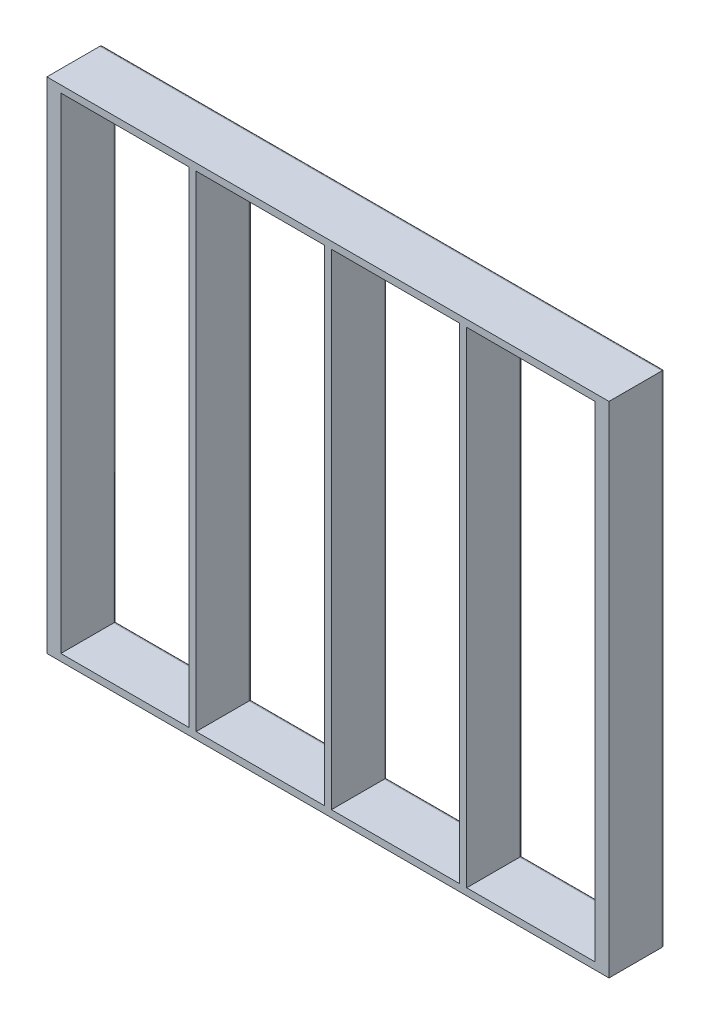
ISO-10303-21;
HEADER;
FILE_DESCRIPTION(('STEP AP214'),'2;1');
FILE_NAME('part.step','',(''),(''),'','','');
FILE_SCHEMA(('AUTOMOTIVE_DESIGN { 1 0 10303 214 1 1 1 1 }'));
ENDSEC;
DATA;
#1=APPLICATION_CONTEXT('core data for automotive mechanical design processes');
#2=APPLICATION_PROTOCOL_DEFINITION('international standard','automotive_design',2000,#1);
#3=PRODUCT_CONTEXT('',#1,'mechanical');
#4=PRODUCT('Part','Part','',(#3));
#5=PRODUCT_RELATED_PRODUCT_CATEGORY('part','',(#4));
#6=PRODUCT_DEFINITION_FORMATION('','',#4);
#7=PRODUCT_DEFINITION_CONTEXT('part definition',#1,'design');
#8=PRODUCT_DEFINITION('design','',#6,#7);
#9=PRODUCT_DEFINITION_SHAPE('','',#8);
#10=(LENGTH_UNIT() NAMED_UNIT(*) SI_UNIT(.MILLI.,.METRE.));
#11=(NAMED_UNIT(*) PLANE_ANGLE_UNIT() SI_UNIT($,.RADIAN.));
#12=(NAMED_UNIT(*) SI_UNIT($,.STERADIAN.) SOLID_ANGLE_UNIT());
#13=UNCERTAINTY_MEASURE_WITH_UNIT(LENGTH_MEASURE(1.E-05),#10,'distance_accuracy_value','');
#14=(GEOMETRIC_REPRESENTATION_CONTEXT(3) GLOBAL_UNCERTAINTY_ASSIGNED_CONTEXT((#13)) GLOBAL_UNIT_ASSIGNED_CONTEXT((#10,
#11,#12)) REPRESENTATION_CONTEXT('',''));
#15=CARTESIAN_POINT('',(0.,0.,0.));
#16=DIRECTION('',(0.,0.,1.));
#17=DIRECTION('',(1.,0.,0.));
#18=AXIS2_PLACEMENT_3D('',#15,#16,#17);
#19=CARTESIAN_POINT('',(168.5,0.,20.));
#20=DIRECTION('',(-1.,0.,0.));
#21=DIRECTION('',(0.,0.,1.));
#22=AXIS2_PLACEMENT_3D('',#19,#20,#21);
#23=PLANE('',#22);
#24=DIRECTION('',(0.,0.,-1.));
#25=VECTOR('',#24,1.);
#26=CARTESIAN_POINT('',(168.5,87.,20.));
#27=LINE('',#26,#25);
#28=CARTESIAN_POINT('',(168.5,87.,20.));
#29=VERTEX_POINT('',#28);
#30=CARTESIAN_POINT('',(168.5,87.,1.));
#31=VERTEX_POINT('',#30);
#32=EDGE_CURVE('E342',#29,#31,#27,.T.);
#33=ORIENTED_EDGE('',*,*,#32,.T.);
#34=DIRECTION('',(0.,1.,0.));
#35=VECTOR('',#34,1.);
#36=CARTESIAN_POINT('',(168.5,-87.,1.));
#37=LINE('',#36,#35);
#38=CARTESIAN_POINT('',(168.5,-87.,1.));
#39=VERTEX_POINT('',#38);
#40=EDGE_CURVE('E487',#31,#39,#37,.F.);
#41=ORIENTED_EDGE('',*,*,#40,.T.);
#42=DIRECTION('',(0.,0.,-1.));
#43=VECTOR('',#42,1.);
#44=CARTESIAN_POINT('',(168.5,-87.,20.));
#45=LINE('',#44,#43);
#46=CARTESIAN_POINT('',(168.5,-87.,20.));
#47=VERTEX_POINT('',#46);
#48=EDGE_CURVE('E355',#47,#39,#45,.T.);
#49=ORIENTED_EDGE('',*,*,#48,.F.);
#50=DIRECTION('',(0.,1.,0.));
#51=VECTOR('',#50,1.);
#52=CARTESIAN_POINT('',(168.5,0.,20.));
#53=LINE('',#52,#51);
#54=EDGE_CURVE('E326',#47,#29,#53,.T.);
#55=ORIENTED_EDGE('',*,*,#54,.T.);
#56=EDGE_LOOP('',(#33,#41,#49,#55));
#57=FACE_BOUND('',#56,.T.);
#58=ADVANCED_FACE('F47',(#57),#23,.T.);
#59=CARTESIAN_POINT('',(0.,-87.,20.));
#60=DIRECTION('',(0.,-1.,0.));
#61=DIRECTION('',(0.,0.,-1.));
#62=AXIS2_PLACEMENT_3D('',#59,#60,#61);
#63=PLANE('',#62);
#64=ORIENTED_EDGE('',*,*,#48,.T.);
#65=DIRECTION('',(-1.,0.,0.));
#66=VECTOR('',#65,1.);
#67=CARTESIAN_POINT('',(0.,-87.,1.));
#68=LINE('',#67,#66);
#69=CARTESIAN_POINT('',(122.5,-87.,1.));
#70=VERTEX_POINT('',#69);
#71=EDGE_CURVE('E359',#39,#70,#68,.T.);
#72=ORIENTED_EDGE('',*,*,#71,.T.);
#73=DIRECTION('',(0.,0.,-1.));
#74=VECTOR('',#73,1.);
#75=CARTESIAN_POINT('',(122.5,-87.,20.));
#76=LINE('',#75,#74);
#77=CARTESIAN_POINT('',(122.5,-87.,20.));
#78=VERTEX_POINT('',#77);
#79=EDGE_CURVE('E351',#78,#70,#76,.T.);
#80=ORIENTED_EDGE('',*,*,#79,.F.);
#81=DIRECTION('',(-1.,0.,0.));
#82=VECTOR('',#81,1.);
#83=CARTESIAN_POINT('',(0.,-87.,20.));
#84=LINE('',#83,#82);
#85=EDGE_CURVE('E330',#47,#78,#84,.T.);
#86=ORIENTED_EDGE('',*,*,#85,.F.);
#87=EDGE_LOOP('',(#64,#72,#80,#86));
#88=FACE_BOUND('',#87,.T.);
#89=ADVANCED_FACE('F634',(#88),#63,.F.);
#90=CARTESIAN_POINT('',(122.5,0.,20.));
#91=DIRECTION('',(-1.,0.,0.));
#92=DIRECTION('',(0.,0.,1.));
#93=AXIS2_PLACEMENT_3D('',#90,#91,#92);
#94=PLANE('',#93);
#95=ORIENTED_EDGE('',*,*,#79,.T.);
#96=DIRECTION('',(0.,1.,0.));
#97=VECTOR('',#96,1.);
#98=CARTESIAN_POINT('',(122.5,0.,1.));
#99=LINE('',#98,#97);
#100=CARTESIAN_POINT('',(122.5,87.,1.));
#101=VERTEX_POINT('',#100);
#102=EDGE_CURVE('E481',#70,#101,#99,.T.);
#103=ORIENTED_EDGE('',*,*,#102,.T.);
#104=DIRECTION('',(0.,0.,-1.));
#105=VECTOR('',#104,1.);
#106=CARTESIAN_POINT('',(122.5,87.,20.));
#107=LINE('',#106,#105);
#108=CARTESIAN_POINT('',(122.5,87.,20.));
#109=VERTEX_POINT('',#108);
#110=EDGE_CURVE('E346',#109,#101,#107,.T.);
#111=ORIENTED_EDGE('',*,*,#110,.F.);
#112=DIRECTION('',(0.,1.,0.));
#113=VECTOR('',#112,1.);
#114=CARTESIAN_POINT('',(122.5,0.,20.));
#115=LINE('',#114,#113);
#116=EDGE_CURVE('E334',#78,#109,#115,.T.);
#117=ORIENTED_EDGE('',*,*,#116,.F.);
#118=EDGE_LOOP('',(#95,#103,#111,#117));
#119=FACE_BOUND('',#118,.T.);
#120=ADVANCED_FACE('F641',(#119),#94,.F.);
#121=CARTESIAN_POINT('',(120.,0.,20.));
#122=DIRECTION('',(-1.,0.,0.));
#123=DIRECTION('',(0.,-1.,0.));
#124=AXIS2_PLACEMENT_3D('',#121,#122,#123);
#125=PLANE('',#124);
#126=DIRECTION('',(0.,0.,-1.));
#127=VECTOR('',#126,1.);
#128=CARTESIAN_POINT('',(120.,87.,20.));
#129=LINE('',#128,#127);
#130=CARTESIAN_POINT('',(120.,87.,20.));
#131=VERTEX_POINT('',#130);
#132=CARTESIAN_POINT('',(120.,87.,1.));
#133=VERTEX_POINT('',#132);
#134=EDGE_CURVE('E360',#131,#133,#129,.T.);
#135=ORIENTED_EDGE('',*,*,#134,.T.);
#136=DIRECTION('',(0.,1.,0.));
#137=VECTOR('',#136,1.);
#138=CARTESIAN_POINT('',(120.,-87.,1.));
#139=LINE('',#138,#137);
#140=CARTESIAN_POINT('',(120.,-87.,1.));
#141=VERTEX_POINT('',#140);
#142=EDGE_CURVE('E500',#133,#141,#139,.F.);
#143=ORIENTED_EDGE('',*,*,#142,.T.);
#144=DIRECTION('',(0.,0.,-1.));
#145=VECTOR('',#144,1.);
#146=CARTESIAN_POINT('',(120.,-87.,20.));
#147=LINE('',#146,#145);
#148=CARTESIAN_POINT('',(120.,-87.,20.));
#149=VERTEX_POINT('',#148);
#150=EDGE_CURVE('E347',#149,#141,#147,.T.);
#151=ORIENTED_EDGE('',*,*,#150,.F.);
#152=DIRECTION('',(0.,1.,0.));
#153=VECTOR('',#152,1.);
#154=CARTESIAN_POINT('',(120.,0.,20.));
#155=LINE('',#154,#153);
#156=EDGE_CURVE('E311',#149,#131,#155,.T.);
#157=ORIENTED_EDGE('',*,*,#156,.T.);
#158=EDGE_LOOP('',(#135,#143,#151,#157));
#159=FACE_BOUND('',#158,.T.);
#160=ADVANCED_FACE('F658',(#159),#125,.T.);
#161=CARTESIAN_POINT('',(0.,-87.,20.));
#162=DIRECTION('',(0.,-1.,0.));
#163=DIRECTION('',(0.,0.,-1.));
#164=AXIS2_PLACEMENT_3D('',#161,#162,#163);
#165=PLANE('',#164);
#166=ORIENTED_EDGE('',*,*,#150,.T.);
#167=DIRECTION('',(-1.,0.,0.));
#168=VECTOR('',#167,1.);
#169=CARTESIAN_POINT('',(0.,-87.,1.));
#170=LINE('',#169,#168);
#171=CARTESIAN_POINT('',(74.,-87.,1.));
#172=VERTEX_POINT('',#171);
#173=EDGE_CURVE('E490',#141,#172,#170,.T.);
#174=ORIENTED_EDGE('',*,*,#173,.T.);
#175=DIRECTION('',(0.,0.,-1.));
#176=VECTOR('',#175,1.);
#177=CARTESIAN_POINT('',(74.,-87.,20.));
#178=LINE('',#177,#176);
#179=CARTESIAN_POINT('',(74.,-87.,20.));
#180=VERTEX_POINT('',#179);
#181=EDGE_CURVE('E369',#180,#172,#178,.T.);
#182=ORIENTED_EDGE('',*,*,#181,.F.);
#183=DIRECTION('',(-1.,0.,0.));
#184=VECTOR('',#183,1.);
#185=CARTESIAN_POINT('',(0.,-87.,20.));
#186=LINE('',#185,#184);
#187=EDGE_CURVE('E315',#149,#180,#186,.T.);
#188=ORIENTED_EDGE('',*,*,#187,.F.);
#189=EDGE_LOOP('',(#166,#174,#182,#188));
#190=FACE_BOUND('',#189,.T.);
#191=ADVANCED_FACE('F654',(#190),#165,.F.);
#192=CARTESIAN_POINT('',(74.,0.,20.));
#193=DIRECTION('',(-1.,0.,0.));
#194=DIRECTION('',(0.,-1.,0.));
#195=AXIS2_PLACEMENT_3D('',#192,#193,#194);
#196=PLANE('',#195);
#197=ORIENTED_EDGE('',*,*,#181,.T.);
#198=DIRECTION('',(0.,1.,0.));
#199=VECTOR('',#198,1.);
#200=CARTESIAN_POINT('',(74.,0.,1.));
#201=LINE('',#200,#199);
#202=CARTESIAN_POINT('',(74.,87.,1.));
#203=VERTEX_POINT('',#202);
#204=EDGE_CURVE('E494',#172,#203,#201,.T.);
#205=ORIENTED_EDGE('',*,*,#204,.T.);
#206=DIRECTION('',(0.,0.,-1.));
#207=VECTOR('',#206,1.);
#208=CARTESIAN_POINT('',(74.,87.,20.));
#209=LINE('',#208,#207);
#210=CARTESIAN_POINT('',(74.,87.,20.));
#211=VERTEX_POINT('',#210);
#212=EDGE_CURVE('E364',#211,#203,#209,.T.);
#213=ORIENTED_EDGE('',*,*,#212,.F.);
#214=DIRECTION('',(0.,1.,0.));
#215=VECTOR('',#214,1.);
#216=CARTESIAN_POINT('',(74.,0.,20.));
#217=LINE('',#216,#215);
#218=EDGE_CURVE('E319',#180,#211,#217,.T.);
#219=ORIENTED_EDGE('',*,*,#218,.F.);
#220=EDGE_LOOP('',(#197,#205,#213,#219));
#221=FACE_BOUND('',#220,.T.);
#222=ADVANCED_FACE('F650',(#221),#196,.F.);
#223=CARTESIAN_POINT('',(71.5,0.,20.));
#224=DIRECTION('',(-1.,0.,0.));
#225=DIRECTION('',(0.,-1.,0.));
#226=AXIS2_PLACEMENT_3D('',#223,#224,#225);
#227=PLANE('',#226);
#228=DIRECTION('',(0.,0.,-1.));
#229=VECTOR('',#228,1.);
#230=CARTESIAN_POINT('',(71.5,87.,20.));
#231=LINE('',#230,#229);
#232=CARTESIAN_POINT('',(71.5,87.,20.));
#233=VERTEX_POINT('',#232);
#234=CARTESIAN_POINT('',(71.5,87.,1.));
#235=VERTEX_POINT('',#234);
#236=EDGE_CURVE('E376',#233,#235,#231,.T.);
#237=ORIENTED_EDGE('',*,*,#236,.T.);
#238=DIRECTION('',(0.,1.,0.));
#239=VECTOR('',#238,1.);
#240=CARTESIAN_POINT('',(71.5,-87.,1.));
#241=LINE('',#240,#239);
#242=CARTESIAN_POINT('',(71.5,-87.,1.));
#243=VERTEX_POINT('',#242);
#244=EDGE_CURVE('E513',#235,#243,#241,.F.);
#245=ORIENTED_EDGE('',*,*,#244,.T.);
#246=DIRECTION('',(0.,0.,-1.));
#247=VECTOR('',#246,1.);
#248=CARTESIAN_POINT('',(71.5,-87.,20.));
#249=LINE('',#248,#247);
#250=CARTESIAN_POINT('',(71.5,-87.,20.));
#251=VERTEX_POINT('',#250);
#252=EDGE_CURVE('E365',#251,#243,#249,.T.);
#253=ORIENTED_EDGE('',*,*,#252,.F.);
#254=DIRECTION('',(0.,1.,0.));
#255=VECTOR('',#254,1.);
#256=CARTESIAN_POINT('',(71.5,0.,20.));
#257=LINE('',#256,#255);
#258=EDGE_CURVE('E296',#251,#233,#257,.T.);
#259=ORIENTED_EDGE('',*,*,#258,.T.);
#260=EDGE_LOOP('',(#237,#245,#253,#259));
#261=FACE_BOUND('',#260,.T.);
#262=ADVANCED_FACE('F653',(#261),#227,.T.);
#263=CARTESIAN_POINT('',(0.,-87.,20.));
#264=DIRECTION('',(0.,1.,0.));
#265=DIRECTION('',(-1.,0.,0.));
#266=AXIS2_PLACEMENT_3D('',#263,#264,#265);
#267=PLANE('',#266);
#268=ORIENTED_EDGE('',*,*,#252,.T.);
#269=DIRECTION('',(1.,0.,0.));
#270=VECTOR('',#269,1.);
#271=CARTESIAN_POINT('',(25.5,-87.,1.));
#272=LINE('',#271,#270);
#273=CARTESIAN_POINT('',(25.5,-87.,1.));
#274=VERTEX_POINT('',#273);
#275=EDGE_CURVE('E503',#243,#274,#272,.F.);
#276=ORIENTED_EDGE('',*,*,#275,.T.);
#277=DIRECTION('',(0.,0.,-1.));
#278=VECTOR('',#277,1.);
#279=CARTESIAN_POINT('',(25.5,-87.,20.));
#280=LINE('',#279,#278);
#281=CARTESIAN_POINT('',(25.5,-87.,20.));
#282=VERTEX_POINT('',#281);
#283=EDGE_CURVE('E385',#282,#274,#280,.T.);
#284=ORIENTED_EDGE('',*,*,#283,.F.);
#285=DIRECTION('',(1.,0.,0.));
#286=VECTOR('',#285,1.);
#287=CARTESIAN_POINT('',(0.,-87.,20.));
#288=LINE('',#287,#286);
#289=EDGE_CURVE('E300',#282,#251,#288,.T.);
#290=ORIENTED_EDGE('',*,*,#289,.T.);
#291=EDGE_LOOP('',(#268,#276,#284,#290));
#292=FACE_BOUND('',#291,.T.);
#293=ADVANCED_FACE('F670',(#292),#267,.T.);
#294=CARTESIAN_POINT('',(25.5,0.,20.));
#295=DIRECTION('',(-1.,0.,0.));
#296=DIRECTION('',(0.,-1.,0.));
#297=AXIS2_PLACEMENT_3D('',#294,#295,#296);
#298=PLANE('',#297);
#299=ORIENTED_EDGE('',*,*,#283,.T.);
#300=DIRECTION('',(0.,1.,0.));
#301=VECTOR('',#300,1.);
#302=CARTESIAN_POINT('',(25.5,0.,1.));
#303=LINE('',#302,#301);
#304=CARTESIAN_POINT('',(25.5,87.,1.));
#305=VERTEX_POINT('',#304);
#306=EDGE_CURVE('E507',#274,#305,#303,.T.);
#307=ORIENTED_EDGE('',*,*,#306,.T.);
#308=DIRECTION('',(0.,0.,-1.));
#309=VECTOR('',#308,1.);
#310=CARTESIAN_POINT('',(25.5,87.,20.));
#311=LINE('',#310,#309);
#312=CARTESIAN_POINT('',(25.5,87.,20.));
#313=VERTEX_POINT('',#312);
#314=EDGE_CURVE('E380',#313,#305,#311,.T.);
#315=ORIENTED_EDGE('',*,*,#314,.F.);
#316=DIRECTION('',(0.,1.,0.));
#317=VECTOR('',#316,1.);
#318=CARTESIAN_POINT('',(25.5,0.,20.));
#319=LINE('',#318,#317);
#320=EDGE_CURVE('E304',#282,#313,#319,.T.);
#321=ORIENTED_EDGE('',*,*,#320,.F.);
#322=EDGE_LOOP('',(#299,#307,#315,#321));
#323=FACE_BOUND('',#322,.T.);
#324=ADVANCED_FACE('F666',(#323),#298,.F.);
#325=CARTESIAN_POINT('',(-28.,0.,20.));
#326=DIRECTION('',(1.,0.,0.));
#327=DIRECTION('',(0.,1.,0.));
#328=AXIS2_PLACEMENT_3D('',#325,#326,#327);
#329=PLANE('',#328);
#330=DIRECTION('',(0.,0.,-1.));
#331=VECTOR('',#330,1.);
#332=CARTESIAN_POINT('',(-28.,89.5,20.));
#333=LINE('',#332,#331);
#334=CARTESIAN_POINT('',(-28.,89.5,20.));
#335=VERTEX_POINT('',#334);
#336=CARTESIAN_POINT('',(-28.,89.5,1.));
#337=VERTEX_POINT('',#336);
#338=EDGE_CURVE('E258',#335,#337,#333,.T.);
#339=ORIENTED_EDGE('',*,*,#338,.T.);
#340=DIRECTION('',(0.,-1.,0.));
#341=VECTOR('',#340,1.);
#342=CARTESIAN_POINT('',(-28.,0.,1.));
#343=LINE('',#342,#341);
#344=CARTESIAN_POINT('',(-28.,-89.5,1.));
#345=VERTEX_POINT('',#344);
#346=EDGE_CURVE('E526',#337,#345,#343,.T.);
#347=ORIENTED_EDGE('',*,*,#346,.T.);
#348=DIRECTION('',(0.,0.,-1.));
#349=VECTOR('',#348,1.);
#350=CARTESIAN_POINT('',(-28.,-89.5,20.));
#351=LINE('',#350,#349);
#352=CARTESIAN_POINT('',(-28.,-89.5,20.));
#353=VERTEX_POINT('',#352);
#354=EDGE_CURVE('E381',#353,#345,#351,.T.);
#355=ORIENTED_EDGE('',*,*,#354,.F.);
#356=DIRECTION('',(0.,-1.,0.));
#357=VECTOR('',#356,1.);
#358=CARTESIAN_POINT('',(-28.,0.,20.));
#359=LINE('',#358,#357);
#360=EDGE_CURVE('E281',#335,#353,#359,.T.);
#361=ORIENTED_EDGE('',*,*,#360,.F.);
#362=EDGE_LOOP('',(#339,#347,#355,#361));
#363=FACE_BOUND('',#362,.T.);
#364=ADVANCED_FACE('F669',(#363),#329,.F.);
#365=CARTESIAN_POINT('',(0.,-89.5,20.));
#366=DIRECTION('',(0.,1.,0.));
#367=DIRECTION('',(-1.,0.,0.));
#368=AXIS2_PLACEMENT_3D('',#365,#366,#367);
#369=PLANE('',#368);
#370=ORIENTED_EDGE('',*,*,#354,.T.);
#371=DIRECTION('',(1.,0.,0.));
#372=VECTOR('',#371,1.);
#373=CARTESIAN_POINT('',(0.,-89.5,1.));
#374=LINE('',#373,#372);
#375=CARTESIAN_POINT('',(173.5,-89.5,1.));
#376=VERTEX_POINT('',#375);
#377=EDGE_CURVE('E516',#345,#376,#374,.T.);
#378=ORIENTED_EDGE('',*,*,#377,.T.);
#379=DIRECTION('',(0.,0.,-1.));
#380=VECTOR('',#379,1.);
#381=CARTESIAN_POINT('',(173.5,-89.5,20.));
#382=LINE('',#381,#380);
#383=CARTESIAN_POINT('',(173.5,-89.5,20.));
#384=VERTEX_POINT('',#383);
#385=EDGE_CURVE('E399',#384,#376,#382,.T.);
#386=ORIENTED_EDGE('',*,*,#385,.F.);
#387=DIRECTION('',(1.,0.,0.));
#388=VECTOR('',#387,1.);
#389=CARTESIAN_POINT('',(0.,-89.5,20.));
#390=LINE('',#389,#388);
#391=EDGE_CURVE('E285',#353,#384,#390,.T.);
#392=ORIENTED_EDGE('',*,*,#391,.F.);
#393=EDGE_LOOP('',(#370,#378,#386,#392));
#394=FACE_BOUND('',#393,.T.);
#395=ADVANCED_FACE('F681',(#394),#369,.F.);
#396=CARTESIAN_POINT('',(173.5,0.,20.));
#397=DIRECTION('',(1.,0.,0.));
#398=DIRECTION('',(0.,1.,0.));
#399=AXIS2_PLACEMENT_3D('',#396,#397,#398);
#400=PLANE('',#399);
#401=ORIENTED_EDGE('',*,*,#385,.T.);
#402=DIRECTION('',(0.,-1.,0.));
#403=VECTOR('',#402,1.);
#404=CARTESIAN_POINT('',(173.5,89.5,1.));
#405=LINE('',#404,#403);
#406=CARTESIAN_POINT('',(173.5,89.5,1.));
#407=VERTEX_POINT('',#406);
#408=EDGE_CURVE('E520',#376,#407,#405,.F.);
#409=ORIENTED_EDGE('',*,*,#408,.T.);
#410=DIRECTION('',(0.,0.,-1.));
#411=VECTOR('',#410,1.);
#412=CARTESIAN_POINT('',(173.5,89.5,20.));
#413=LINE('',#412,#411);
#414=CARTESIAN_POINT('',(173.5,89.5,20.));
#415=VERTEX_POINT('',#414);
#416=EDGE_CURVE('E395',#415,#407,#413,.T.);
#417=ORIENTED_EDGE('',*,*,#416,.F.);
#418=DIRECTION('',(0.,-1.,0.));
#419=VECTOR('',#418,1.);
#420=CARTESIAN_POINT('',(173.5,0.,20.));
#421=LINE('',#420,#419);
#422=EDGE_CURVE('E288',#415,#384,#421,.T.);
#423=ORIENTED_EDGE('',*,*,#422,.T.);
#424=EDGE_LOOP('',(#401,#409,#417,#423));
#425=FACE_BOUND('',#424,.T.);
#426=ADVANCED_FACE('F678',(#425),#400,.T.);
#427=CARTESIAN_POINT('',(23.,0.,20.));
#428=DIRECTION('',(-1.,0.,0.));
#429=DIRECTION('',(0.,0.,1.));
#430=AXIS2_PLACEMENT_3D('',#427,#428,#429);
#431=PLANE('',#430);
#432=DIRECTION('',(0.,0.,-1.));
#433=VECTOR('',#432,1.);
#434=CARTESIAN_POINT('',(23.,87.,20.));
#435=LINE('',#434,#433);
#436=CARTESIAN_POINT('',(23.,87.,20.));
#437=VERTEX_POINT('',#436);
#438=CARTESIAN_POINT('',(23.,87.,1.));
#439=VERTEX_POINT('',#438);
#440=EDGE_CURVE('E341',#437,#439,#435,.T.);
#441=ORIENTED_EDGE('',*,*,#440,.T.);
#442=DIRECTION('',(0.,1.,0.));
#443=VECTOR('',#442,1.);
#444=CARTESIAN_POINT('',(23.,-87.,1.));
#445=LINE('',#444,#443);
#446=CARTESIAN_POINT('',(23.,-87.,1.));
#447=VERTEX_POINT('',#446);
#448=EDGE_CURVE('E11',#439,#447,#445,.F.);
#449=ORIENTED_EDGE('',*,*,#448,.T.);
#450=DIRECTION('',(0.,0.,-1.));
#451=VECTOR('',#450,1.);
#452=CARTESIAN_POINT('',(23.,-87.,20.));
#453=LINE('',#452,#451);
#454=CARTESIAN_POINT('',(23.,-87.,20.));
#455=VERTEX_POINT('',#454);
#456=EDGE_CURVE('E248',#455,#447,#453,.T.);
#457=ORIENTED_EDGE('',*,*,#456,.F.);
#458=DIRECTION('',(0.,1.,0.));
#459=VECTOR('',#458,1.);
#460=CARTESIAN_POINT('',(23.,0.,20.));
#461=LINE('',#460,#459);
#462=EDGE_CURVE('E251',#455,#437,#461,.T.);
#463=ORIENTED_EDGE('',*,*,#462,.T.);
#464=EDGE_LOOP('',(#441,#449,#457,#463));
#465=FACE_BOUND('',#464,.T.);
#466=ADVANCED_FACE('F250',(#465),#431,.T.);
#467=CARTESIAN_POINT('',(0.,-87.,20.));
#468=DIRECTION('',(0.,1.,0.));
#469=DIRECTION('',(0.,0.,1.));
#470=AXIS2_PLACEMENT_3D('',#467,#468,#469);
#471=PLANE('',#470);
#472=ORIENTED_EDGE('',*,*,#456,.T.);
#473=DIRECTION('',(1.,0.,0.));
#474=VECTOR('',#473,1.);
#475=CARTESIAN_POINT('',(-23.,-87.,1.));
#476=LINE('',#475,#474);
#477=CARTESIAN_POINT('',(-23.,-87.,1.));
#478=VERTEX_POINT('',#477);
#479=EDGE_CURVE('E529',#447,#478,#476,.F.);
#480=ORIENTED_EDGE('',*,*,#479,.T.);
#481=DIRECTION('',(0.,0.,-1.));
#482=VECTOR('',#481,1.);
#483=CARTESIAN_POINT('',(-23.,-87.,20.));
#484=LINE('',#483,#482);
#485=CARTESIAN_POINT('',(-23.,-87.,20.));
#486=VERTEX_POINT('',#485);
#487=EDGE_CURVE('E259',#486,#478,#484,.T.);
#488=ORIENTED_EDGE('',*,*,#487,.F.);
#489=DIRECTION('',(1.,0.,0.));
#490=VECTOR('',#489,1.);
#491=CARTESIAN_POINT('',(0.,-87.,20.));
#492=LINE('',#491,#490);
#493=EDGE_CURVE('E265',#486,#455,#492,.T.);
#494=ORIENTED_EDGE('',*,*,#493,.T.);
#495=EDGE_LOOP('',(#472,#480,#488,#494));
#496=FACE_BOUND('',#495,.T.);
#497=ADVANCED_FACE('F271',(#496),#471,.T.);
#498=CARTESIAN_POINT('',(-23.,0.,20.));
#499=DIRECTION('',(-1.,0.,0.));
#500=DIRECTION('',(0.,0.,1.));
#501=AXIS2_PLACEMENT_3D('',#498,#499,#500);
#502=PLANE('',#501);
#503=ORIENTED_EDGE('',*,*,#487,.T.);
#504=DIRECTION('',(0.,1.,0.));
#505=VECTOR('',#504,1.);
#506=CARTESIAN_POINT('',(-23.,0.,1.));
#507=LINE('',#506,#505);
#508=CARTESIAN_POINT('',(-23.,87.,1.));
#509=VERTEX_POINT('',#508);
#510=EDGE_CURVE('E72',#478,#509,#507,.T.);
#511=ORIENTED_EDGE('',*,*,#510,.T.);
#512=DIRECTION('',(0.,0.,-1.));
#513=VECTOR('',#512,1.);
#514=CARTESIAN_POINT('',(-23.,87.,20.));
#515=LINE('',#514,#513);
#516=CARTESIAN_POINT('',(-23.,87.,20.));
#517=VERTEX_POINT('',#516);
#518=EDGE_CURVE('E408',#517,#509,#515,.T.);
#519=ORIENTED_EDGE('',*,*,#518,.F.);
#520=DIRECTION('',(0.,1.,0.));
#521=VECTOR('',#520,1.);
#522=CARTESIAN_POINT('',(-23.,0.,20.));
#523=LINE('',#522,#521);
#524=EDGE_CURVE('E274',#486,#517,#523,.T.);
#525=ORIENTED_EDGE('',*,*,#524,.F.);
#526=EDGE_LOOP('',(#503,#511,#519,#525));
#527=FACE_BOUND('',#526,.T.);
#528=ADVANCED_FACE('F616',(#527),#502,.F.);
#529=CARTESIAN_POINT('',(0.,87.,20.));
#530=DIRECTION('',(0.,-1.,0.));
#531=DIRECTION('',(0.,0.,-1.));
#532=AXIS2_PLACEMENT_3D('',#529,#530,#531);
#533=PLANE('',#532);
#534=ORIENTED_EDGE('',*,*,#212,.T.);
#535=DIRECTION('',(-1.,0.,0.));
#536=VECTOR('',#535,1.);
#537=CARTESIAN_POINT('',(120.,87.,1.));
#538=LINE('',#537,#536);
#539=EDGE_CURVE('E497',#203,#133,#538,.F.);
#540=ORIENTED_EDGE('',*,*,#539,.T.);
#541=ORIENTED_EDGE('',*,*,#134,.F.);
#542=DIRECTION('',(-1.,0.,0.));
#543=VECTOR('',#542,1.);
#544=CARTESIAN_POINT('',(0.,87.,20.));
#545=LINE('',#544,#543);
#546=EDGE_CURVE('E322',#131,#211,#545,.T.);
#547=ORIENTED_EDGE('',*,*,#546,.T.);
#548=EDGE_LOOP('',(#534,#540,#541,#547));
#549=FACE_BOUND('',#548,.T.);
#550=ADVANCED_FACE('F646',(#549),#533,.T.);
#551=CARTESIAN_POINT('',(0.,87.,20.));
#552=DIRECTION('',(0.,1.,0.));
#553=DIRECTION('',(0.,0.,1.));
#554=AXIS2_PLACEMENT_3D('',#551,#552,#553);
#555=PLANE('',#554);
#556=ORIENTED_EDGE('',*,*,#314,.T.);
#557=DIRECTION('',(1.,0.,0.));
#558=VECTOR('',#557,1.);
#559=CARTESIAN_POINT('',(0.,87.,1.));
#560=LINE('',#559,#558);
#561=EDGE_CURVE('E510',#305,#235,#560,.T.);
#562=ORIENTED_EDGE('',*,*,#561,.T.);
#563=ORIENTED_EDGE('',*,*,#236,.F.);
#564=DIRECTION('',(1.,0.,0.));
#565=VECTOR('',#564,1.);
#566=CARTESIAN_POINT('',(0.,87.,20.));
#567=LINE('',#566,#565);
#568=EDGE_CURVE('E308',#313,#233,#567,.T.);
#569=ORIENTED_EDGE('',*,*,#568,.F.);
#570=EDGE_LOOP('',(#556,#562,#563,#569));
#571=FACE_BOUND('',#570,.T.);
#572=ADVANCED_FACE('F628',(#571),#555,.F.);
#573=CARTESIAN_POINT('',(0.,89.5,20.));
#574=DIRECTION('',(0.,1.,0.));
#575=DIRECTION('',(0.,0.,1.));
#576=AXIS2_PLACEMENT_3D('',#573,#574,#575);
#577=PLANE('',#576);
#578=ORIENTED_EDGE('',*,*,#416,.T.);
#579=DIRECTION('',(1.,0.,0.));
#580=VECTOR('',#579,1.);
#581=CARTESIAN_POINT('',(-28.,89.5,1.));
#582=LINE('',#581,#580);
#583=EDGE_CURVE('E523',#407,#337,#582,.F.);
#584=ORIENTED_EDGE('',*,*,#583,.T.);
#585=ORIENTED_EDGE('',*,*,#338,.F.);
#586=DIRECTION('',(1.,0.,0.));
#587=VECTOR('',#586,1.);
#588=CARTESIAN_POINT('',(0.,89.5,20.));
#589=LINE('',#588,#587);
#590=EDGE_CURVE('E292',#335,#415,#589,.T.);
#591=ORIENTED_EDGE('',*,*,#590,.T.);
#592=EDGE_LOOP('',(#578,#584,#585,#591));
#593=FACE_BOUND('',#592,.T.);
#594=ADVANCED_FACE('F620',(#593),#577,.T.);
#595=CARTESIAN_POINT('',(0.,87.,20.));
#596=DIRECTION('',(0.,1.,0.));
#597=DIRECTION('',(0.,0.,1.));
#598=AXIS2_PLACEMENT_3D('',#595,#596,#597);
#599=PLANE('',#598);
#600=ORIENTED_EDGE('',*,*,#518,.T.);
#601=DIRECTION('',(1.,0.,0.));
#602=VECTOR('',#601,1.);
#603=CARTESIAN_POINT('',(0.,87.,1.));
#604=LINE('',#603,#602);
#605=EDGE_CURVE('E57',#509,#439,#604,.T.);
#606=ORIENTED_EDGE('',*,*,#605,.T.);
#607=ORIENTED_EDGE('',*,*,#440,.F.);
#608=DIRECTION('',(1.,0.,0.));
#609=VECTOR('',#608,1.);
#610=CARTESIAN_POINT('',(0.,87.,20.));
#611=LINE('',#610,#609);
#612=EDGE_CURVE('E267',#517,#437,#611,.T.);
#613=ORIENTED_EDGE('',*,*,#612,.F.);
#614=EDGE_LOOP('',(#600,#606,#607,#613));
#615=FACE_BOUND('',#614,.T.);
#616=ADVANCED_FACE('F617',(#615),#599,.F.);
#617=CARTESIAN_POINT('',(0.,87.,20.));
#618=DIRECTION('',(0.,-1.,0.));
#619=DIRECTION('',(0.,0.,-1.));
#620=AXIS2_PLACEMENT_3D('',#617,#618,#619);
#621=PLANE('',#620);
#622=ORIENTED_EDGE('',*,*,#110,.T.);
#623=DIRECTION('',(-1.,0.,0.));
#624=VECTOR('',#623,1.);
#625=CARTESIAN_POINT('',(168.5,87.,1.));
#626=LINE('',#625,#624);
#627=EDGE_CURVE('E484',#101,#31,#626,.F.);
#628=ORIENTED_EDGE('',*,*,#627,.T.);
#629=ORIENTED_EDGE('',*,*,#32,.F.);
#630=DIRECTION('',(-1.,0.,0.));
#631=VECTOR('',#630,1.);
#632=CARTESIAN_POINT('',(0.,87.,20.));
#633=LINE('',#632,#631);
#634=EDGE_CURVE('E337',#29,#109,#633,.T.);
#635=ORIENTED_EDGE('',*,*,#634,.T.);
#636=EDGE_LOOP('',(#622,#628,#629,#635));
#637=FACE_BOUND('',#636,.T.);
#638=ADVANCED_FACE('F619',(#637),#621,.T.);
#639=CARTESIAN_POINT('',(0.,0.,20.));
#640=DIRECTION('',(0.,0.,1.));
#641=DIRECTION('',(1.,0.,0.));
#642=AXIS2_PLACEMENT_3D('',#639,#640,#641);
#643=PLANE('',#642);
#644=ORIENTED_EDGE('',*,*,#462,.F.);
#645=ORIENTED_EDGE('',*,*,#493,.F.);
#646=ORIENTED_EDGE('',*,*,#524,.T.);
#647=ORIENTED_EDGE('',*,*,#612,.T.);
#648=EDGE_LOOP('',(#644,#645,#646,#647));
#649=FACE_BOUND('',#648,.T.);
#650=ORIENTED_EDGE('',*,*,#360,.T.);
#651=ORIENTED_EDGE('',*,*,#391,.T.);
#652=ORIENTED_EDGE('',*,*,#422,.F.);
#653=ORIENTED_EDGE('',*,*,#590,.F.);
#654=EDGE_LOOP('',(#650,#651,#652,#653));
#655=FACE_BOUND('',#654,.T.);
#656=ORIENTED_EDGE('',*,*,#258,.F.);
#657=ORIENTED_EDGE('',*,*,#289,.F.);
#658=ORIENTED_EDGE('',*,*,#320,.T.);
#659=ORIENTED_EDGE('',*,*,#568,.T.);
#660=EDGE_LOOP('',(#656,#657,#658,#659));
#661=FACE_BOUND('',#660,.T.);
#662=ORIENTED_EDGE('',*,*,#156,.F.);
#663=ORIENTED_EDGE('',*,*,#187,.T.);
#664=ORIENTED_EDGE('',*,*,#218,.T.);
#665=ORIENTED_EDGE('',*,*,#546,.F.);
#666=EDGE_LOOP('',(#662,#663,#664,#665));
#667=FACE_BOUND('',#666,.T.);
#668=ORIENTED_EDGE('',*,*,#54,.F.);
#669=ORIENTED_EDGE('',*,*,#85,.T.);
#670=ORIENTED_EDGE('',*,*,#116,.T.);
#671=ORIENTED_EDGE('',*,*,#634,.F.);
#672=EDGE_LOOP('',(#668,#669,#670,#671));
#673=FACE_BOUND('',#672,.T.);
#674=ADVANCED_FACE('F263',(#649,#655,#661,#667,#673),#643,.T.);
#675=CARTESIAN_POINT('',(0.,0.,0.));
#676=DIRECTION('',(0.,0.,1.));
#677=DIRECTION('',(1.,0.,0.));
#678=AXIS2_PLACEMENT_3D('',#675,#676,#677);
#679=PLANE('',#678);
#680=DIRECTION('',(0.,1.,0.));
#681=VECTOR('',#680,1.);
#682=CARTESIAN_POINT('',(121.5,0.,0.));
#683=LINE('',#682,#681);
#684=CARTESIAN_POINT('',(121.5,88.,0.));
#685=VERTEX_POINT('',#684);
#686=CARTESIAN_POINT('',(121.5,-88.,0.));
#687=VERTEX_POINT('',#686);
#688=EDGE_CURVE('E474',#685,#687,#683,.F.);
#689=ORIENTED_EDGE('',*,*,#688,.T.);
#690=DIRECTION('',(-1.,0.,0.));
#691=VECTOR('',#690,1.);
#692=CARTESIAN_POINT('',(0.,-88.,0.));
#693=LINE('',#692,#691);
#694=CARTESIAN_POINT('',(169.5,-88.,0.));
#695=VERTEX_POINT('',#694);
#696=EDGE_CURVE('E477',#687,#695,#693,.F.);
#697=ORIENTED_EDGE('',*,*,#696,.T.);
#698=DIRECTION('',(0.,1.,0.));
#699=VECTOR('',#698,1.);
#700=CARTESIAN_POINT('',(169.5,87.,0.));
#701=LINE('',#700,#699);
#702=CARTESIAN_POINT('',(169.5,88.,0.));
#703=VERTEX_POINT('',#702);
#704=EDGE_CURVE('E468',#695,#703,#701,.T.);
#705=ORIENTED_EDGE('',*,*,#704,.T.);
#706=DIRECTION('',(-1.,0.,0.));
#707=VECTOR('',#706,1.);
#708=CARTESIAN_POINT('',(122.5,88.,0.));
#709=LINE('',#708,#707);
#710=EDGE_CURVE('E471',#703,#685,#709,.T.);
#711=ORIENTED_EDGE('',*,*,#710,.T.);
#712=EDGE_LOOP('',(#689,#697,#705,#711));
#713=FACE_BOUND('',#712,.T.);
#714=DIRECTION('',(0.,1.,0.));
#715=VECTOR('',#714,1.);
#716=CARTESIAN_POINT('',(73.,0.,0.));
#717=LINE('',#716,#715);
#718=CARTESIAN_POINT('',(73.,88.,0.));
#719=VERTEX_POINT('',#718);
#720=CARTESIAN_POINT('',(73.,-88.,0.));
#721=VERTEX_POINT('',#720);
#722=EDGE_CURVE('E461',#719,#721,#717,.F.);
#723=ORIENTED_EDGE('',*,*,#722,.T.);
#724=DIRECTION('',(-1.,0.,0.));
#725=VECTOR('',#724,1.);
#726=CARTESIAN_POINT('',(0.,-88.,0.));
#727=LINE('',#726,#725);
#728=CARTESIAN_POINT('',(121.,-88.,0.));
#729=VERTEX_POINT('',#728);
#730=EDGE_CURVE('E464',#721,#729,#727,.F.);
#731=ORIENTED_EDGE('',*,*,#730,.T.);
#732=DIRECTION('',(0.,1.,0.));
#733=VECTOR('',#732,1.);
#734=CARTESIAN_POINT('',(121.,87.,0.));
#735=LINE('',#734,#733);
#736=CARTESIAN_POINT('',(121.,88.,0.));
#737=VERTEX_POINT('',#736);
#738=EDGE_CURVE('E455',#729,#737,#735,.T.);
#739=ORIENTED_EDGE('',*,*,#738,.T.);
#740=DIRECTION('',(-1.,0.,0.));
#741=VECTOR('',#740,1.);
#742=CARTESIAN_POINT('',(74.,88.,0.));
#743=LINE('',#742,#741);
#744=EDGE_CURVE('E458',#737,#719,#743,.T.);
#745=ORIENTED_EDGE('',*,*,#744,.T.);
#746=EDGE_LOOP('',(#723,#731,#739,#745));
#747=FACE_BOUND('',#746,.T.);
#748=DIRECTION('',(0.,1.,0.));
#749=VECTOR('',#748,1.);
#750=CARTESIAN_POINT('',(24.5,0.,0.));
#751=LINE('',#750,#749);
#752=CARTESIAN_POINT('',(24.5,88.,0.));
#753=VERTEX_POINT('',#752);
#754=CARTESIAN_POINT('',(24.5,-88.,0.));
#755=VERTEX_POINT('',#754);
#756=EDGE_CURVE('E448',#753,#755,#751,.F.);
#757=ORIENTED_EDGE('',*,*,#756,.T.);
#758=DIRECTION('',(1.,0.,0.));
#759=VECTOR('',#758,1.);
#760=CARTESIAN_POINT('',(71.5,-88.,0.));
#761=LINE('',#760,#759);
#762=CARTESIAN_POINT('',(72.5,-88.,0.));
#763=VERTEX_POINT('',#762);
#764=EDGE_CURVE('E451',#755,#763,#761,.T.);
#765=ORIENTED_EDGE('',*,*,#764,.T.);
#766=DIRECTION('',(0.,1.,0.));
#767=VECTOR('',#766,1.);
#768=CARTESIAN_POINT('',(72.5,87.,0.));
#769=LINE('',#768,#767);
#770=CARTESIAN_POINT('',(72.5,88.,0.));
#771=VERTEX_POINT('',#770);
#772=EDGE_CURVE('E442',#763,#771,#769,.T.);
#773=ORIENTED_EDGE('',*,*,#772,.T.);
#774=DIRECTION('',(1.,0.,0.));
#775=VECTOR('',#774,1.);
#776=CARTESIAN_POINT('',(0.,88.,0.));
#777=LINE('',#776,#775);
#778=EDGE_CURVE('E445',#771,#753,#777,.F.);
#779=ORIENTED_EDGE('',*,*,#778,.T.);
#780=EDGE_LOOP('',(#757,#765,#773,#779));
#781=FACE_BOUND('',#780,.T.);
#782=DIRECTION('',(0.,-1.,0.));
#783=VECTOR('',#782,1.);
#784=CARTESIAN_POINT('',(172.5,-89.5,0.));
#785=LINE('',#784,#783);
#786=CARTESIAN_POINT('',(172.5,88.5,0.));
#787=VERTEX_POINT('',#786);
#788=CARTESIAN_POINT('',(172.5,-88.5,0.));
#789=VERTEX_POINT('',#788);
#790=EDGE_CURVE('E435',#787,#789,#785,.T.);
#791=ORIENTED_EDGE('',*,*,#790,.T.);
#792=DIRECTION('',(1.,0.,0.));
#793=VECTOR('',#792,1.);
#794=CARTESIAN_POINT('',(0.,-88.5,0.));
#795=LINE('',#794,#793);
#796=CARTESIAN_POINT('',(-27.,-88.5,0.));
#797=VERTEX_POINT('',#796);
#798=EDGE_CURVE('E438',#789,#797,#795,.F.);
#799=ORIENTED_EDGE('',*,*,#798,.T.);
#800=DIRECTION('',(0.,-1.,0.));
#801=VECTOR('',#800,1.);
#802=CARTESIAN_POINT('',(-27.,0.,0.));
#803=LINE('',#802,#801);
#804=CARTESIAN_POINT('',(-27.,88.5,0.));
#805=VERTEX_POINT('',#804);
#806=EDGE_CURVE('E429',#797,#805,#803,.F.);
#807=ORIENTED_EDGE('',*,*,#806,.T.);
#808=DIRECTION('',(1.,0.,0.));
#809=VECTOR('',#808,1.);
#810=CARTESIAN_POINT('',(173.5,88.5,0.));
#811=LINE('',#810,#809);
#812=EDGE_CURVE('E432',#805,#787,#811,.T.);
#813=ORIENTED_EDGE('',*,*,#812,.T.);
#814=EDGE_LOOP('',(#791,#799,#807,#813));
#815=FACE_BOUND('',#814,.T.);
#816=DIRECTION('',(0.,1.,0.));
#817=VECTOR('',#816,1.);
#818=CARTESIAN_POINT('',(-24.,0.,0.));
#819=LINE('',#818,#817);
#820=CARTESIAN_POINT('',(-24.,88.,0.));
#821=VERTEX_POINT('',#820);
#822=CARTESIAN_POINT('',(-24.,-88.,0.));
#823=VERTEX_POINT('',#822);
#824=EDGE_CURVE('E422',#821,#823,#819,.F.);
#825=ORIENTED_EDGE('',*,*,#824,.T.);
#826=DIRECTION('',(1.,0.,0.));
#827=VECTOR('',#826,1.);
#828=CARTESIAN_POINT('',(23.,-88.,0.));
#829=LINE('',#828,#827);
#830=CARTESIAN_POINT('',(24.,-88.,0.));
#831=VERTEX_POINT('',#830);
#832=EDGE_CURVE('E425',#823,#831,#829,.T.);
#833=ORIENTED_EDGE('',*,*,#832,.T.);
#834=DIRECTION('',(0.,1.,0.));
#835=VECTOR('',#834,1.);
#836=CARTESIAN_POINT('',(24.,87.,0.));
#837=LINE('',#836,#835);
#838=CARTESIAN_POINT('',(24.,88.,0.));
#839=VERTEX_POINT('',#838);
#840=EDGE_CURVE('E416',#831,#839,#837,.T.);
#841=ORIENTED_EDGE('',*,*,#840,.T.);
#842=DIRECTION('',(1.,0.,0.));
#843=VECTOR('',#842,1.);
#844=CARTESIAN_POINT('',(0.,88.,0.));
#845=LINE('',#844,#843);
#846=EDGE_CURVE('E419',#839,#821,#845,.F.);
#847=ORIENTED_EDGE('',*,*,#846,.T.);
#848=EDGE_LOOP('',(#825,#833,#841,#847));
#849=FACE_BOUND('',#848,.T.);
#850=ADVANCED_FACE('F712',(#713,#747,#781,#815,#849),#679,.F.);
#851=CARTESIAN_POINT('',(0.,88.,1.));
#852=DIRECTION('',(1.,0.,0.));
#853=DIRECTION('',(0.,0.,-1.));
#854=AXIS2_PLACEMENT_3D('',#851,#852,#853);
#855=CYLINDRICAL_SURFACE('',#854,1.);
#856=CARTESIAN_POINT('',(121.5,88.,1.));
#857=DIRECTION('',(0.707106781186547,0.707106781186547,0.));
#858=DIRECTION('',(-0.707106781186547,0.707106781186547,0.));
#859=AXIS2_PLACEMENT_3D('',#856,#857,#858);
#860=ELLIPSE('',#859,1.41421356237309,1.);
#861=EDGE_CURVE('E543',#685,#101,#860,.F.);
#862=ORIENTED_EDGE('',*,*,#861,.F.);
#863=ORIENTED_EDGE('',*,*,#710,.F.);
#864=CARTESIAN_POINT('',(169.5,88.,1.));
#865=DIRECTION('',(0.707106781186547,-0.707106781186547,0.));
#866=DIRECTION('',(0.707106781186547,0.707106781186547,0.));
#867=AXIS2_PLACEMENT_3D('',#864,#865,#866);
#868=ELLIPSE('',#867,1.41421356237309,1.);
#869=EDGE_CURVE('E269',#31,#703,#868,.T.);
#870=ORIENTED_EDGE('',*,*,#869,.F.);
#871=ORIENTED_EDGE('',*,*,#627,.F.);
#872=EDGE_LOOP('',(#862,#863,#870,#871));
#873=FACE_BOUND('',#872,.T.);
#874=ADVANCED_FACE('F734',(#873),#855,.T.);
#875=CARTESIAN_POINT('',(169.5,0.,1.));
#876=DIRECTION('',(0.,-1.,0.));
#877=DIRECTION('',(0.,0.,-1.));
#878=AXIS2_PLACEMENT_3D('',#875,#876,#877);
#879=CYLINDRICAL_SURFACE('',#878,1.);
#880=ORIENTED_EDGE('',*,*,#869,.T.);
#881=ORIENTED_EDGE('',*,*,#704,.F.);
#882=CARTESIAN_POINT('',(169.5,-88.,1.));
#883=DIRECTION('',(-0.707106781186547,-0.707106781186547,0.));
#884=DIRECTION('',(-0.707106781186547,0.707106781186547,0.));
#885=AXIS2_PLACEMENT_3D('',#882,#883,#884);
#886=ELLIPSE('',#885,1.41421356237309,1.);
#887=EDGE_CURVE('E539',#39,#695,#886,.T.);
#888=ORIENTED_EDGE('',*,*,#887,.F.);
#889=ORIENTED_EDGE('',*,*,#40,.F.);
#890=EDGE_LOOP('',(#880,#881,#888,#889));
#891=FACE_BOUND('',#890,.T.);
#892=ADVANCED_FACE('F747',(#891),#879,.T.);
#893=CARTESIAN_POINT('',(121.5,0.,1.));
#894=DIRECTION('',(0.,1.,0.));
#895=DIRECTION('',(0.,0.,1.));
#896=AXIS2_PLACEMENT_3D('',#893,#894,#895);
#897=CYLINDRICAL_SURFACE('',#896,1.);
#898=ORIENTED_EDGE('',*,*,#861,.T.);
#899=ORIENTED_EDGE('',*,*,#102,.F.);
#900=CARTESIAN_POINT('',(121.5,-88.,1.));
#901=DIRECTION('',(-0.707106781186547,0.707106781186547,0.));
#902=DIRECTION('',(-0.707106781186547,-0.707106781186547,0.));
#903=AXIS2_PLACEMENT_3D('',#900,#901,#902);
#904=ELLIPSE('',#903,1.41421356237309,1.);
#905=EDGE_CURVE('E536',#687,#70,#904,.F.);
#906=ORIENTED_EDGE('',*,*,#905,.F.);
#907=ORIENTED_EDGE('',*,*,#688,.F.);
#908=EDGE_LOOP('',(#898,#899,#906,#907));
#909=FACE_BOUND('',#908,.T.);
#910=ADVANCED_FACE('F738',(#909),#897,.T.);
#911=CARTESIAN_POINT('',(0.,-88.,1.));
#912=DIRECTION('',(-1.,0.,0.));
#913=DIRECTION('',(0.,0.,1.));
#914=AXIS2_PLACEMENT_3D('',#911,#912,#913);
#915=CYLINDRICAL_SURFACE('',#914,1.);
#916=ORIENTED_EDGE('',*,*,#887,.T.);
#917=ORIENTED_EDGE('',*,*,#696,.F.);
#918=ORIENTED_EDGE('',*,*,#905,.T.);
#919=ORIENTED_EDGE('',*,*,#71,.F.);
#920=EDGE_LOOP('',(#916,#917,#918,#919));
#921=FACE_BOUND('',#920,.T.);
#922=ADVANCED_FACE('F744',(#921),#915,.T.);
#923=CARTESIAN_POINT('',(0.,88.,1.));
#924=DIRECTION('',(1.,0.,0.));
#925=DIRECTION('',(0.,0.,-1.));
#926=AXIS2_PLACEMENT_3D('',#923,#924,#925);
#927=CYLINDRICAL_SURFACE('',#926,1.);
#928=CARTESIAN_POINT('',(73.,88.,1.));
#929=DIRECTION('',(0.707106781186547,0.707106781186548,0.));
#930=DIRECTION('',(-0.707106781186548,0.707106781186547,0.));
#931=AXIS2_PLACEMENT_3D('',#928,#929,#930);
#932=ELLIPSE('',#931,1.4142135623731,1.);
#933=EDGE_CURVE('E557',#719,#203,#932,.F.);
#934=ORIENTED_EDGE('',*,*,#933,.F.);
#935=ORIENTED_EDGE('',*,*,#744,.F.);
#936=CARTESIAN_POINT('',(121.,88.,1.));
#937=DIRECTION('',(0.707106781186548,-0.707106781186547,0.));
#938=DIRECTION('',(0.707106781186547,0.707106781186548,0.));
#939=AXIS2_PLACEMENT_3D('',#936,#937,#938);
#940=ELLIPSE('',#939,1.41421356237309,1.);
#941=EDGE_CURVE('E540',#133,#737,#940,.T.);
#942=ORIENTED_EDGE('',*,*,#941,.F.);
#943=ORIENTED_EDGE('',*,*,#539,.F.);
#944=EDGE_LOOP('',(#934,#935,#942,#943));
#945=FACE_BOUND('',#944,.T.);
#946=ADVANCED_FACE('F770',(#945),#927,.T.);
#947=CARTESIAN_POINT('',(121.,0.,1.));
#948=DIRECTION('',(0.,-1.,0.));
#949=DIRECTION('',(1.,0.,0.));
#950=AXIS2_PLACEMENT_3D('',#947,#948,#949);
#951=CYLINDRICAL_SURFACE('',#950,1.);
#952=ORIENTED_EDGE('',*,*,#941,.T.);
#953=ORIENTED_EDGE('',*,*,#738,.F.);
#954=CARTESIAN_POINT('',(121.,-88.,1.));
#955=DIRECTION('',(-0.707106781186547,-0.707106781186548,0.));
#956=DIRECTION('',(-0.707106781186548,0.707106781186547,0.));
#957=AXIS2_PLACEMENT_3D('',#954,#955,#956);
#958=ELLIPSE('',#957,1.4142135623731,1.);
#959=EDGE_CURVE('E553',#141,#729,#958,.T.);
#960=ORIENTED_EDGE('',*,*,#959,.F.);
#961=ORIENTED_EDGE('',*,*,#142,.F.);
#962=EDGE_LOOP('',(#952,#953,#960,#961));
#963=FACE_BOUND('',#962,.T.);
#964=ADVANCED_FACE('F766',(#963),#951,.T.);
#965=CARTESIAN_POINT('',(73.,0.,1.));
#966=DIRECTION('',(0.,1.,0.));
#967=DIRECTION('',(-1.,0.,0.));
#968=AXIS2_PLACEMENT_3D('',#965,#966,#967);
#969=CYLINDRICAL_SURFACE('',#968,1.);
#970=ORIENTED_EDGE('',*,*,#933,.T.);
#971=ORIENTED_EDGE('',*,*,#204,.F.);
#972=CARTESIAN_POINT('',(73.,-88.,1.));
#973=DIRECTION('',(-0.707106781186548,0.707106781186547,0.));
#974=DIRECTION('',(-0.707106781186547,-0.707106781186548,0.));
#975=AXIS2_PLACEMENT_3D('',#972,#973,#974);
#976=ELLIPSE('',#975,1.41421356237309,1.);
#977=EDGE_CURVE('E550',#721,#172,#976,.F.);
#978=ORIENTED_EDGE('',*,*,#977,.F.);
#979=ORIENTED_EDGE('',*,*,#722,.F.);
#980=EDGE_LOOP('',(#970,#971,#978,#979));
#981=FACE_BOUND('',#980,.T.);
#982=ADVANCED_FACE('F762',(#981),#969,.T.);
#983=CARTESIAN_POINT('',(0.,-88.,1.));
#984=DIRECTION('',(-1.,0.,0.));
#985=DIRECTION('',(0.,0.,1.));
#986=AXIS2_PLACEMENT_3D('',#983,#984,#985);
#987=CYLINDRICAL_SURFACE('',#986,1.);
#988=ORIENTED_EDGE('',*,*,#959,.T.);
#989=ORIENTED_EDGE('',*,*,#730,.F.);
#990=ORIENTED_EDGE('',*,*,#977,.T.);
#991=ORIENTED_EDGE('',*,*,#173,.F.);
#992=EDGE_LOOP('',(#988,#989,#990,#991));
#993=FACE_BOUND('',#992,.T.);
#994=ADVANCED_FACE('F758',(#993),#987,.T.);
#995=CARTESIAN_POINT('',(0.,88.,1.));
#996=DIRECTION('',(1.,0.,0.));
#997=DIRECTION('',(0.,0.,-1.));
#998=AXIS2_PLACEMENT_3D('',#995,#996,#997);
#999=CYLINDRICAL_SURFACE('',#998,1.);
#1000=CARTESIAN_POINT('',(72.5000000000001,88.,1.));
#1001=DIRECTION('',(0.707106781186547,-0.707106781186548,0.));
#1002=DIRECTION('',(0.707106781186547,0.707106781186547,0.));
#1003=AXIS2_PLACEMENT_3D('',#1000,#1001,#1002);
#1004=ELLIPSE('',#1003,1.4142135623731,1.);
#1005=EDGE_CURVE('E571',#235,#771,#1004,.T.);
#1006=ORIENTED_EDGE('',*,*,#1005,.F.);
#1007=ORIENTED_EDGE('',*,*,#561,.F.);
#1008=CARTESIAN_POINT('',(24.5,88.,1.));
#1009=DIRECTION('',(0.707106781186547,0.707106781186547,0.));
#1010=DIRECTION('',(-0.707106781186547,0.707106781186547,0.));
#1011=AXIS2_PLACEMENT_3D('',#1008,#1009,#1010);
#1012=ELLIPSE('',#1011,1.41421356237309,1.);
#1013=EDGE_CURVE('E554',#753,#305,#1012,.F.);
#1014=ORIENTED_EDGE('',*,*,#1013,.F.);
#1015=ORIENTED_EDGE('',*,*,#778,.F.);
#1016=EDGE_LOOP('',(#1006,#1007,#1014,#1015));
#1017=FACE_BOUND('',#1016,.T.);
#1018=ADVANCED_FACE('F761',(#1017),#999,.T.);
#1019=CARTESIAN_POINT('',(24.5,0.,1.));
#1020=DIRECTION('',(0.,1.,0.));
#1021=DIRECTION('',(-1.,0.,0.));
#1022=AXIS2_PLACEMENT_3D('',#1019,#1020,#1021);
#1023=CYLINDRICAL_SURFACE('',#1022,1.);
#1024=ORIENTED_EDGE('',*,*,#1013,.T.);
#1025=ORIENTED_EDGE('',*,*,#306,.F.);
#1026=CARTESIAN_POINT('',(24.5,-88.,1.));
#1027=DIRECTION('',(-0.707106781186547,0.707106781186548,0.));
#1028=DIRECTION('',(-0.707106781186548,-0.707106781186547,0.));
#1029=AXIS2_PLACEMENT_3D('',#1026,#1027,#1028);
#1030=ELLIPSE('',#1029,1.41421356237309,1.);
#1031=EDGE_CURVE('E567',#755,#274,#1030,.F.);
#1032=ORIENTED_EDGE('',*,*,#1031,.F.);
#1033=ORIENTED_EDGE('',*,*,#756,.F.);
#1034=EDGE_LOOP('',(#1024,#1025,#1032,#1033));
#1035=FACE_BOUND('',#1034,.T.);
#1036=ADVANCED_FACE('F782',(#1035),#1023,.T.);
#1037=CARTESIAN_POINT('',(72.5,0.,1.));
#1038=DIRECTION('',(0.,-1.,0.));
#1039=DIRECTION('',(1.,0.,0.));
#1040=AXIS2_PLACEMENT_3D('',#1037,#1038,#1039);
#1041=CYLINDRICAL_SURFACE('',#1040,1.);
#1042=ORIENTED_EDGE('',*,*,#1005,.T.);
#1043=ORIENTED_EDGE('',*,*,#772,.F.);
#1044=CARTESIAN_POINT('',(72.5,-88.,1.));
#1045=DIRECTION('',(-0.707106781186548,-0.707106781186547,0.));
#1046=DIRECTION('',(-0.707106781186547,0.707106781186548,0.));
#1047=AXIS2_PLACEMENT_3D('',#1044,#1045,#1046);
#1048=ELLIPSE('',#1047,1.4142135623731,1.);
#1049=EDGE_CURVE('E564',#243,#763,#1048,.T.);
#1050=ORIENTED_EDGE('',*,*,#1049,.F.);
#1051=ORIENTED_EDGE('',*,*,#244,.F.);
#1052=EDGE_LOOP('',(#1042,#1043,#1050,#1051));
#1053=FACE_BOUND('',#1052,.T.);
#1054=ADVANCED_FACE('F778',(#1053),#1041,.T.);
#1055=CARTESIAN_POINT('',(0.,-88.,1.));
#1056=DIRECTION('',(-1.,0.,0.));
#1057=DIRECTION('',(0.,-1.,0.));
#1058=AXIS2_PLACEMENT_3D('',#1055,#1056,#1057);
#1059=CYLINDRICAL_SURFACE('',#1058,1.);
#1060=ORIENTED_EDGE('',*,*,#1031,.T.);
#1061=ORIENTED_EDGE('',*,*,#275,.F.);
#1062=ORIENTED_EDGE('',*,*,#1049,.T.);
#1063=ORIENTED_EDGE('',*,*,#764,.F.);
#1064=EDGE_LOOP('',(#1060,#1061,#1062,#1063));
#1065=FACE_BOUND('',#1064,.T.);
#1066=ADVANCED_FACE('F775',(#1065),#1059,.T.);
#1067=CARTESIAN_POINT('',(0.,88.5,1.));
#1068=DIRECTION('',(-1.,0.,0.));
#1069=DIRECTION('',(0.,0.,1.));
#1070=AXIS2_PLACEMENT_3D('',#1067,#1068,#1069);
#1071=CYLINDRICAL_SURFACE('',#1070,1.);
#1072=CARTESIAN_POINT('',(172.5,88.5,1.));
#1073=DIRECTION('',(-0.707106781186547,0.707106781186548,0.));
#1074=DIRECTION('',(-0.707106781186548,-0.707106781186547,0.));
#1075=AXIS2_PLACEMENT_3D('',#1072,#1073,#1074);
#1076=ELLIPSE('',#1075,1.4142135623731,1.);
#1077=EDGE_CURVE('E584',#787,#407,#1076,.F.);
#1078=ORIENTED_EDGE('',*,*,#1077,.F.);
#1079=ORIENTED_EDGE('',*,*,#812,.F.);
#1080=CARTESIAN_POINT('',(-27.,88.5,1.));
#1081=DIRECTION('',(-0.707106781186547,-0.707106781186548,0.));
#1082=DIRECTION('',(0.707106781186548,-0.707106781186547,0.));
#1083=AXIS2_PLACEMENT_3D('',#1080,#1081,#1082);
#1084=ELLIPSE('',#1083,1.4142135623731,1.);
#1085=EDGE_CURVE('E568',#337,#805,#1084,.T.);
#1086=ORIENTED_EDGE('',*,*,#1085,.F.);
#1087=ORIENTED_EDGE('',*,*,#583,.F.);
#1088=EDGE_LOOP('',(#1078,#1079,#1086,#1087));
#1089=FACE_BOUND('',#1088,.T.);
#1090=ADVANCED_FACE('F698',(#1089),#1071,.T.);
#1091=CARTESIAN_POINT('',(-27.,0.,1.));
#1092=DIRECTION('',(0.,-1.,0.));
#1093=DIRECTION('',(1.,0.,0.));
#1094=AXIS2_PLACEMENT_3D('',#1091,#1092,#1093);
#1095=CYLINDRICAL_SURFACE('',#1094,1.);
#1096=ORIENTED_EDGE('',*,*,#1085,.T.);
#1097=ORIENTED_EDGE('',*,*,#806,.F.);
#1098=CARTESIAN_POINT('',(-27.,-88.5,1.));
#1099=DIRECTION('',(0.707106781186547,-0.707106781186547,0.));
#1100=DIRECTION('',(-0.707106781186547,-0.707106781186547,0.));
#1101=AXIS2_PLACEMENT_3D('',#1098,#1099,#1100);
#1102=ELLIPSE('',#1101,1.41421356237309,1.);
#1103=EDGE_CURVE('E581',#345,#797,#1102,.T.);
#1104=ORIENTED_EDGE('',*,*,#1103,.F.);
#1105=ORIENTED_EDGE('',*,*,#346,.F.);
#1106=EDGE_LOOP('',(#1096,#1097,#1104,#1105));
#1107=FACE_BOUND('',#1106,.T.);
#1108=ADVANCED_FACE('F702',(#1107),#1095,.T.);
#1109=CARTESIAN_POINT('',(172.5,0.,1.));
#1110=DIRECTION('',(0.,1.,0.));
#1111=DIRECTION('',(-1.,0.,0.));
#1112=AXIS2_PLACEMENT_3D('',#1109,#1110,#1111);
#1113=CYLINDRICAL_SURFACE('',#1112,1.);
#1114=ORIENTED_EDGE('',*,*,#1077,.T.);
#1115=ORIENTED_EDGE('',*,*,#408,.F.);
#1116=CARTESIAN_POINT('',(172.5,-88.5,1.));
#1117=DIRECTION('',(0.707106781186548,0.707106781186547,0.));
#1118=DIRECTION('',(-0.707106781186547,0.707106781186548,0.));
#1119=AXIS2_PLACEMENT_3D('',#1116,#1117,#1118);
#1120=ELLIPSE('',#1119,1.4142135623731,1.);
#1121=EDGE_CURVE('E578',#789,#376,#1120,.F.);
#1122=ORIENTED_EDGE('',*,*,#1121,.F.);
#1123=ORIENTED_EDGE('',*,*,#790,.F.);
#1124=EDGE_LOOP('',(#1114,#1115,#1122,#1123));
#1125=FACE_BOUND('',#1124,.T.);
#1126=ADVANCED_FACE('F792',(#1125),#1113,.T.);
#1127=CARTESIAN_POINT('',(0.,-88.5,1.));
#1128=DIRECTION('',(1.,0.,0.));
#1129=DIRECTION('',(0.,1.,0.));
#1130=AXIS2_PLACEMENT_3D('',#1127,#1128,#1129);
#1131=CYLINDRICAL_SURFACE('',#1130,1.);
#1132=ORIENTED_EDGE('',*,*,#1103,.T.);
#1133=ORIENTED_EDGE('',*,*,#798,.F.);
#1134=ORIENTED_EDGE('',*,*,#1121,.T.);
#1135=ORIENTED_EDGE('',*,*,#377,.F.);
#1136=EDGE_LOOP('',(#1132,#1133,#1134,#1135));
#1137=FACE_BOUND('',#1136,.T.);
#1138=ADVANCED_FACE('F706',(#1137),#1131,.T.);
#1139=CARTESIAN_POINT('',(0.,88.,1.));
#1140=DIRECTION('',(1.,0.,0.));
#1141=DIRECTION('',(0.,0.,-1.));
#1142=AXIS2_PLACEMENT_3D('',#1139,#1140,#1141);
#1143=CYLINDRICAL_SURFACE('',#1142,1.);
#1144=CARTESIAN_POINT('',(24.,88.,1.));
#1145=DIRECTION('',(0.707106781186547,-0.707106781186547,0.));
#1146=DIRECTION('',(0.707106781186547,0.707106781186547,0.));
#1147=AXIS2_PLACEMENT_3D('',#1144,#1145,#1146);
#1148=ELLIPSE('',#1147,1.41421356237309,1.);
#1149=EDGE_CURVE('E596',#439,#839,#1148,.T.);
#1150=ORIENTED_EDGE('',*,*,#1149,.F.);
#1151=ORIENTED_EDGE('',*,*,#605,.F.);
#1152=CARTESIAN_POINT('',(-24.,88.,1.));
#1153=DIRECTION('',(0.707106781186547,0.707106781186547,0.));
#1154=DIRECTION('',(-0.707106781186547,0.707106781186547,0.));
#1155=AXIS2_PLACEMENT_3D('',#1152,#1153,#1154);
#1156=ELLIPSE('',#1155,1.41421356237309,1.);
#1157=EDGE_CURVE('E51',#821,#509,#1156,.F.);
#1158=ORIENTED_EDGE('',*,*,#1157,.F.);
#1159=ORIENTED_EDGE('',*,*,#846,.F.);
#1160=EDGE_LOOP('',(#1150,#1151,#1158,#1159));
#1161=FACE_BOUND('',#1160,.T.);
#1162=ADVANCED_FACE('F49',(#1161),#1143,.T.);
#1163=CARTESIAN_POINT('',(-24.,0.,1.));
#1164=DIRECTION('',(0.,1.,0.));
#1165=DIRECTION('',(0.,0.,1.));
#1166=AXIS2_PLACEMENT_3D('',#1163,#1164,#1165);
#1167=CYLINDRICAL_SURFACE('',#1166,1.);
#1168=ORIENTED_EDGE('',*,*,#1157,.T.);
#1169=ORIENTED_EDGE('',*,*,#510,.F.);
#1170=CARTESIAN_POINT('',(-24.,-88.,1.));
#1171=DIRECTION('',(-0.707106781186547,0.707106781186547,0.));
#1172=DIRECTION('',(-0.707106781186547,-0.707106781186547,0.));
#1173=AXIS2_PLACEMENT_3D('',#1170,#1171,#1172);
#1174=ELLIPSE('',#1173,1.41421356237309,1.);
#1175=EDGE_CURVE('E594',#823,#478,#1174,.F.);
#1176=ORIENTED_EDGE('',*,*,#1175,.F.);
#1177=ORIENTED_EDGE('',*,*,#824,.F.);
#1178=EDGE_LOOP('',(#1168,#1169,#1176,#1177));
#1179=FACE_BOUND('',#1178,.T.);
#1180=ADVANCED_FACE('F607',(#1179),#1167,.T.);
#1181=CARTESIAN_POINT('',(24.,0.,1.));
#1182=DIRECTION('',(0.,-1.,0.));
#1183=DIRECTION('',(0.,0.,-1.));
#1184=AXIS2_PLACEMENT_3D('',#1181,#1182,#1183);
#1185=CYLINDRICAL_SURFACE('',#1184,1.);
#1186=ORIENTED_EDGE('',*,*,#1149,.T.);
#1187=ORIENTED_EDGE('',*,*,#840,.F.);
#1188=CARTESIAN_POINT('',(24.,-88.,1.));
#1189=DIRECTION('',(-0.707106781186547,-0.707106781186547,0.));
#1190=DIRECTION('',(-0.707106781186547,0.707106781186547,0.));
#1191=AXIS2_PLACEMENT_3D('',#1188,#1189,#1190);
#1192=ELLIPSE('',#1191,1.41421356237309,1.);
#1193=EDGE_CURVE('E591',#447,#831,#1192,.T.);
#1194=ORIENTED_EDGE('',*,*,#1193,.F.);
#1195=ORIENTED_EDGE('',*,*,#448,.F.);
#1196=EDGE_LOOP('',(#1186,#1187,#1194,#1195));
#1197=FACE_BOUND('',#1196,.T.);
#1198=ADVANCED_FACE('F612',(#1197),#1185,.T.);
#1199=CARTESIAN_POINT('',(0.,-88.,1.));
#1200=DIRECTION('',(-1.,0.,0.));
#1201=DIRECTION('',(0.,0.,1.));
#1202=AXIS2_PLACEMENT_3D('',#1199,#1200,#1201);
#1203=CYLINDRICAL_SURFACE('',#1202,1.);
#1204=ORIENTED_EDGE('',*,*,#1175,.T.);
#1205=ORIENTED_EDGE('',*,*,#479,.F.);
#1206=ORIENTED_EDGE('',*,*,#1193,.T.);
#1207=ORIENTED_EDGE('',*,*,#832,.F.);
#1208=EDGE_LOOP('',(#1204,#1205,#1206,#1207));
#1209=FACE_BOUND('',#1208,.T.);
#1210=ADVANCED_FACE('F615',(#1209),#1203,.T.);
#1211=CLOSED_SHELL('',(#58,#89,#120,#160,#191,#222,#262,#293,#324,#364,#395,#426,#466,#497,#528,
#550,#572,#594,#616,#638,#674,#850,#874,#892,#910,#922,#946,#964,#982,#994,#1018,#1036,#1054,
#1066,#1090,#1108,#1126,#1138,#1162,#1180,#1198,#1210));
#1212=MANIFOLD_SOLID_BREP('B2',#1211);
#1213=ADVANCED_BREP_SHAPE_REPRESENTATION('',(#18,#1212),#14);
#1214=SHAPE_DEFINITION_REPRESENTATION(#9,#1213);
ENDSEC;
END-ISO-10303-21;
